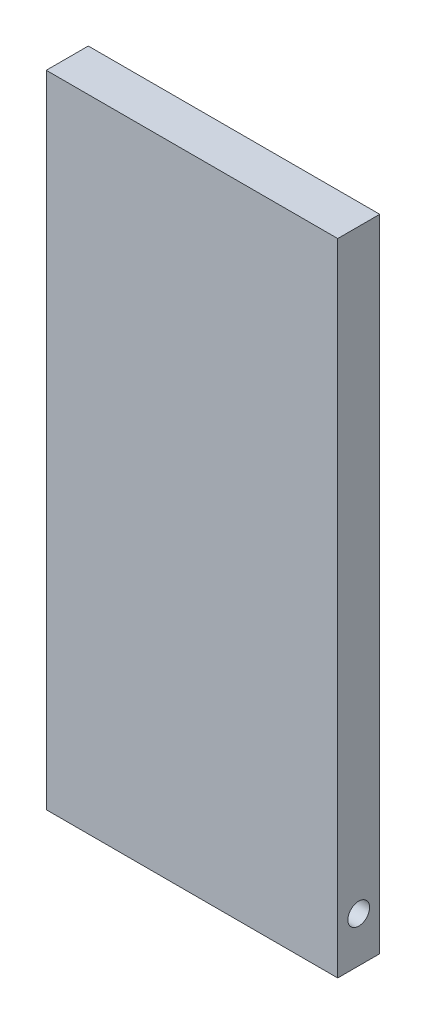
ISO-10303-21;
HEADER;
FILE_DESCRIPTION(('STEP AP214'),'2;1');
FILE_NAME('part.step','',(''),(''),'','','');
FILE_SCHEMA(('AUTOMOTIVE_DESIGN { 1 0 10303 214 1 1 1 1 }'));
ENDSEC;
DATA;
#1=APPLICATION_CONTEXT('core data for automotive mechanical design processes');
#2=APPLICATION_PROTOCOL_DEFINITION('international standard','automotive_design',2000,#1);
#3=PRODUCT_CONTEXT('',#1,'mechanical');
#4=PRODUCT('Part','Part','',(#3));
#5=PRODUCT_RELATED_PRODUCT_CATEGORY('part','',(#4));
#6=PRODUCT_DEFINITION_FORMATION('','',#4);
#7=PRODUCT_DEFINITION_CONTEXT('part definition',#1,'design');
#8=PRODUCT_DEFINITION('design','',#6,#7);
#9=PRODUCT_DEFINITION_SHAPE('','',#8);
#10=(LENGTH_UNIT() NAMED_UNIT(*) SI_UNIT(.MILLI.,.METRE.));
#11=(NAMED_UNIT(*) PLANE_ANGLE_UNIT() SI_UNIT($,.RADIAN.));
#12=(NAMED_UNIT(*) SI_UNIT($,.STERADIAN.) SOLID_ANGLE_UNIT());
#13=UNCERTAINTY_MEASURE_WITH_UNIT(LENGTH_MEASURE(1.E-05),#10,'distance_accuracy_value','');
#14=(GEOMETRIC_REPRESENTATION_CONTEXT(3) GLOBAL_UNCERTAINTY_ASSIGNED_CONTEXT((#13)) GLOBAL_UNIT_ASSIGNED_CONTEXT((#10,
#11,#12)) REPRESENTATION_CONTEXT('',''));
#15=CARTESIAN_POINT('',(0.,0.,0.));
#16=DIRECTION('',(0.,0.,1.));
#17=DIRECTION('',(1.,0.,0.));
#18=AXIS2_PLACEMENT_3D('',#15,#16,#17);
#19=CARTESIAN_POINT('',(-1.97609092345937,141.630304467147,5.));
#20=DIRECTION('',(1.,0.,0.));
#21=DIRECTION('',(0.,1.,0.));
#22=AXIS2_PLACEMENT_3D('',#19,#20,#21);
#23=PLANE('',#22);
#24=CARTESIAN_POINT('',(-1.97609092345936,0.,0.));
#25=DIRECTION('',(1.,0.,0.));
#26=DIRECTION('',(0.,1.,0.));
#27=AXIS2_PLACEMENT_3D('',#24,#25,#26);
#28=CIRCLE('',#27,2.57900086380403);
#29=CARTESIAN_POINT('',(-1.97609092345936,2.57900086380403,0.));
#30=VERTEX_POINT('',#29);
#31=EDGE_CURVE('E98',#30,#30,#28,.T.);
#32=ORIENTED_EDGE('',*,*,#31,.T.);
#33=EDGE_LOOP('',(#32));
#34=FACE_BOUND('',#33,.T.);
#35=DIRECTION('',(0.,-1.,0.));
#36=VECTOR('',#35,1.);
#37=CARTESIAN_POINT('',(-1.97609092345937,141.630304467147,-5.));
#38=LINE('',#37,#36);
#39=CARTESIAN_POINT('',(-1.97609092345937,141.630304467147,-5.));
#40=VERTEX_POINT('',#39);
#41=CARTESIAN_POINT('',(-1.97609092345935,-10.7696955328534,-5.));
#42=VERTEX_POINT('',#41);
#43=EDGE_CURVE('E95',#40,#42,#38,.T.);
#44=ORIENTED_EDGE('',*,*,#43,.T.);
#45=DIRECTION('',(0.,0.,-1.));
#46=VECTOR('',#45,1.);
#47=CARTESIAN_POINT('',(-1.97609092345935,-10.7696955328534,5.));
#48=LINE('',#47,#46);
#49=CARTESIAN_POINT('',(-1.97609092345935,-10.7696955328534,5.));
#50=VERTEX_POINT('',#49);
#51=EDGE_CURVE('E11',#50,#42,#48,.T.);
#52=ORIENTED_EDGE('',*,*,#51,.F.);
#53=DIRECTION('',(0.,-1.,0.));
#54=VECTOR('',#53,1.);
#55=CARTESIAN_POINT('',(-1.97609092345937,141.630304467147,5.));
#56=LINE('',#55,#54);
#57=CARTESIAN_POINT('',(-1.97609092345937,141.630304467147,5.));
#58=VERTEX_POINT('',#57);
#59=EDGE_CURVE('E83',#58,#50,#56,.T.);
#60=ORIENTED_EDGE('',*,*,#59,.F.);
#61=DIRECTION('',(0.,0.,-1.));
#62=VECTOR('',#61,1.);
#63=CARTESIAN_POINT('',(-1.97609092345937,141.630304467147,5.));
#64=LINE('',#63,#62);
#65=EDGE_CURVE('E91',#58,#40,#64,.T.);
#66=ORIENTED_EDGE('',*,*,#65,.T.);
#67=EDGE_LOOP('',(#44,#52,#60,#66));
#68=FACE_BOUND('',#67,.T.);
#69=ADVANCED_FACE('F32',(#34,#68),#23,.F.);
#70=CARTESIAN_POINT('',(-1.97609092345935,-10.7696955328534,5.));
#71=DIRECTION('',(0.,1.,0.));
#72=DIRECTION('',(0.,0.,1.));
#73=AXIS2_PLACEMENT_3D('',#70,#71,#72);
#74=PLANE('',#73);
#75=DIRECTION('',(1.,0.,0.));
#76=VECTOR('',#75,1.);
#77=CARTESIAN_POINT('',(-1.97609092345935,-10.7696955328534,-5.));
#78=LINE('',#77,#76);
#79=CARTESIAN_POINT('',(67.3847004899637,-10.7696955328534,-5.));
#80=VERTEX_POINT('',#79);
#81=EDGE_CURVE('E87',#42,#80,#78,.T.);
#82=ORIENTED_EDGE('',*,*,#81,.T.);
#83=DIRECTION('',(0.,0.,-1.));
#84=VECTOR('',#83,1.);
#85=CARTESIAN_POINT('',(67.3847004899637,-10.7696955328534,5.));
#86=LINE('',#85,#84);
#87=CARTESIAN_POINT('',(67.3847004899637,-10.7696955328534,5.));
#88=VERTEX_POINT('',#87);
#89=EDGE_CURVE('E40',#88,#80,#86,.T.);
#90=ORIENTED_EDGE('',*,*,#89,.F.);
#91=DIRECTION('',(1.,0.,0.));
#92=VECTOR('',#91,1.);
#93=CARTESIAN_POINT('',(-1.97609092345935,-10.7696955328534,5.));
#94=LINE('',#93,#92);
#95=EDGE_CURVE('E78',#50,#88,#94,.T.);
#96=ORIENTED_EDGE('',*,*,#95,.F.);
#97=ORIENTED_EDGE('',*,*,#51,.T.);
#98=EDGE_LOOP('',(#82,#90,#96,#97));
#99=FACE_BOUND('',#98,.T.);
#100=ADVANCED_FACE('F86',(#99),#74,.F.);
#101=CARTESIAN_POINT('',(67.3847004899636,141.630304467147,5.));
#102=DIRECTION('',(-1.,0.,0.));
#103=DIRECTION('',(0.,-1.,0.));
#104=AXIS2_PLACEMENT_3D('',#101,#102,#103);
#105=PLANE('',#104);
#106=CARTESIAN_POINT('',(67.3847004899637,0.,0.));
#107=DIRECTION('',(1.,0.,0.));
#108=DIRECTION('',(0.,1.,0.));
#109=AXIS2_PLACEMENT_3D('',#106,#107,#108);
#110=CIRCLE('',#109,2.57900086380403);
#111=CARTESIAN_POINT('',(67.3847004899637,2.57900086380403,0.));
#112=VERTEX_POINT('',#111);
#113=EDGE_CURVE('E109',#112,#112,#110,.T.);
#114=ORIENTED_EDGE('',*,*,#113,.F.);
#115=EDGE_LOOP('',(#114));
#116=FACE_BOUND('',#115,.T.);
#117=DIRECTION('',(0.,1.,0.));
#118=VECTOR('',#117,1.);
#119=CARTESIAN_POINT('',(67.3847004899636,141.630304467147,-5.));
#120=LINE('',#119,#118);
#121=CARTESIAN_POINT('',(67.3847004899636,141.630304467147,-5.));
#122=VERTEX_POINT('',#121);
#123=EDGE_CURVE('E65',#80,#122,#120,.T.);
#124=ORIENTED_EDGE('',*,*,#123,.T.);
#125=DIRECTION('',(0.,0.,-1.));
#126=VECTOR('',#125,1.);
#127=CARTESIAN_POINT('',(67.3847004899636,141.630304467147,5.));
#128=LINE('',#127,#126);
#129=CARTESIAN_POINT('',(67.3847004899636,141.630304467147,5.));
#130=VERTEX_POINT('',#129);
#131=EDGE_CURVE('E88',#130,#122,#128,.T.);
#132=ORIENTED_EDGE('',*,*,#131,.F.);
#133=DIRECTION('',(0.,1.,0.));
#134=VECTOR('',#133,1.);
#135=CARTESIAN_POINT('',(67.3847004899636,141.630304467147,5.));
#136=LINE('',#135,#134);
#137=EDGE_CURVE('E81',#88,#130,#136,.T.);
#138=ORIENTED_EDGE('',*,*,#137,.F.);
#139=ORIENTED_EDGE('',*,*,#89,.T.);
#140=EDGE_LOOP('',(#124,#132,#138,#139));
#141=FACE_BOUND('',#140,.T.);
#142=ADVANCED_FACE('F89',(#116,#141),#105,.F.);
#143=CARTESIAN_POINT('',(-1.97609092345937,141.630304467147,5.));
#144=DIRECTION('',(0.,-1.,0.));
#145=DIRECTION('',(0.,0.,-1.));
#146=AXIS2_PLACEMENT_3D('',#143,#144,#145);
#147=PLANE('',#146);
#148=DIRECTION('',(-1.,0.,0.));
#149=VECTOR('',#148,1.);
#150=CARTESIAN_POINT('',(-1.97609092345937,141.630304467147,-5.));
#151=LINE('',#150,#149);
#152=EDGE_CURVE('E71',#122,#40,#151,.T.);
#153=ORIENTED_EDGE('',*,*,#152,.T.);
#154=ORIENTED_EDGE('',*,*,#65,.F.);
#155=DIRECTION('',(-1.,0.,0.));
#156=VECTOR('',#155,1.);
#157=CARTESIAN_POINT('',(-1.97609092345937,141.630304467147,5.));
#158=LINE('',#157,#156);
#159=EDGE_CURVE('E48',#130,#58,#158,.T.);
#160=ORIENTED_EDGE('',*,*,#159,.F.);
#161=ORIENTED_EDGE('',*,*,#131,.T.);
#162=EDGE_LOOP('',(#153,#154,#160,#161));
#163=FACE_BOUND('',#162,.T.);
#164=ADVANCED_FACE('F103',(#163),#147,.F.);
#165=CARTESIAN_POINT('',(-1.97609092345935,-10.7696955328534,5.));
#166=DIRECTION('',(0.,0.,1.));
#167=DIRECTION('',(1.,0.,0.));
#168=AXIS2_PLACEMENT_3D('',#165,#166,#167);
#169=PLANE('',#168);
#170=ORIENTED_EDGE('',*,*,#59,.T.);
#171=ORIENTED_EDGE('',*,*,#95,.T.);
#172=ORIENTED_EDGE('',*,*,#137,.T.);
#173=ORIENTED_EDGE('',*,*,#159,.T.);
#174=EDGE_LOOP('',(#170,#171,#172,#173));
#175=FACE_BOUND('',#174,.T.);
#176=ADVANCED_FACE('F79',(#175),#169,.T.);
#177=CARTESIAN_POINT('',(-1.97609092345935,-10.7696955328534,-5.));
#178=DIRECTION('',(0.,0.,1.));
#179=DIRECTION('',(1.,0.,0.));
#180=AXIS2_PLACEMENT_3D('',#177,#178,#179);
#181=PLANE('',#180);
#182=ORIENTED_EDGE('',*,*,#43,.F.);
#183=ORIENTED_EDGE('',*,*,#152,.F.);
#184=ORIENTED_EDGE('',*,*,#123,.F.);
#185=ORIENTED_EDGE('',*,*,#81,.F.);
#186=EDGE_LOOP('',(#182,#183,#184,#185));
#187=FACE_BOUND('',#186,.T.);
#188=ADVANCED_FACE('F106',(#187),#181,.F.);
#189=CARTESIAN_POINT('',(-1.97609092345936,0.,0.));
#190=DIRECTION('',(1.,0.,0.));
#191=DIRECTION('',(0.,1.,0.));
#192=AXIS2_PLACEMENT_3D('',#189,#190,#191);
#193=CYLINDRICAL_SURFACE('',#192,2.57900086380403);
#194=ORIENTED_EDGE('',*,*,#31,.F.);
#195=EDGE_LOOP('',(#194));
#196=FACE_BOUND('',#195,.T.);
#197=ORIENTED_EDGE('',*,*,#113,.T.);
#198=EDGE_LOOP('',(#197));
#199=FACE_BOUND('',#198,.T.);
#200=ADVANCED_FACE('F116',(#196,#199),#193,.F.);
#201=CLOSED_SHELL('',(#69,#100,#142,#164,#176,#188,#200));
#202=MANIFOLD_SOLID_BREP('B2',#201);
#203=ADVANCED_BREP_SHAPE_REPRESENTATION('',(#18,#202),#14);
#204=SHAPE_DEFINITION_REPRESENTATION(#9,#203);
ENDSEC;
END-ISO-10303-21;
